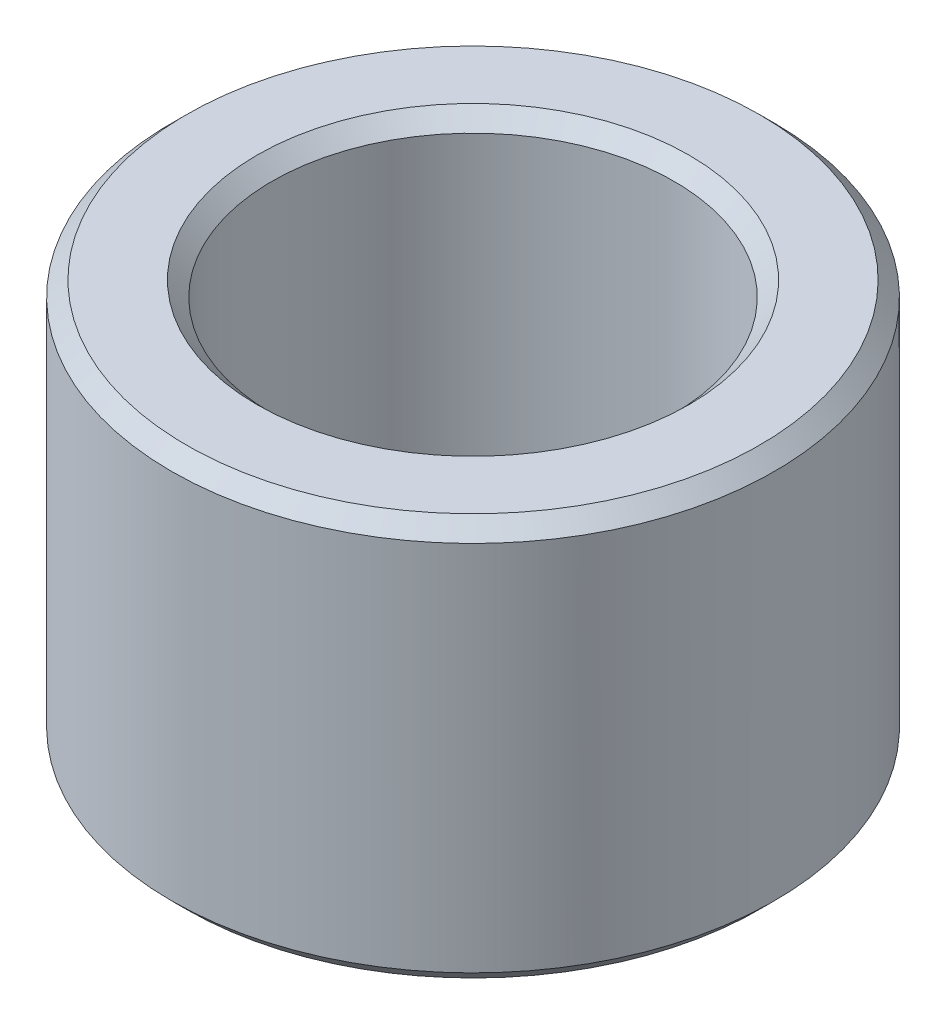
from build123d import *

# Parameters (mm, degrees)
ESQUISSE1_W     = 2
ESQUISSE1_H     = 8
CHANFREIN1_SIZE = 0.3


with BuildPart() as part:
    # Esquisse1 → Base-R_volution (revolve)
    with BuildSketch(Plane.XY, mode=Mode.PRIVATE) as base_r_volution_sk:
        with Locations((5, 4)):
            Rectangle(ESQUISSE1_W, ESQUISSE1_H)
    revolve(base_r_volution_sk.sketch.rotate(Axis((0, 30, 0), (0, -1, 0)), 90), axis=Axis((0, 30, 0), (0, -1, 0)))

    # Chanfrein1
    chanfrein1_edges = [part.edges().sort_by_distance(p)[0] for p in [
        (0, 8, -4),
        (0, 0, -4),
        (0, 0, -6),
        (0, 8, -6),
    ]]
    chamfer(chanfrein1_edges, length=CHANFREIN1_SIZE)


solid = part.part
